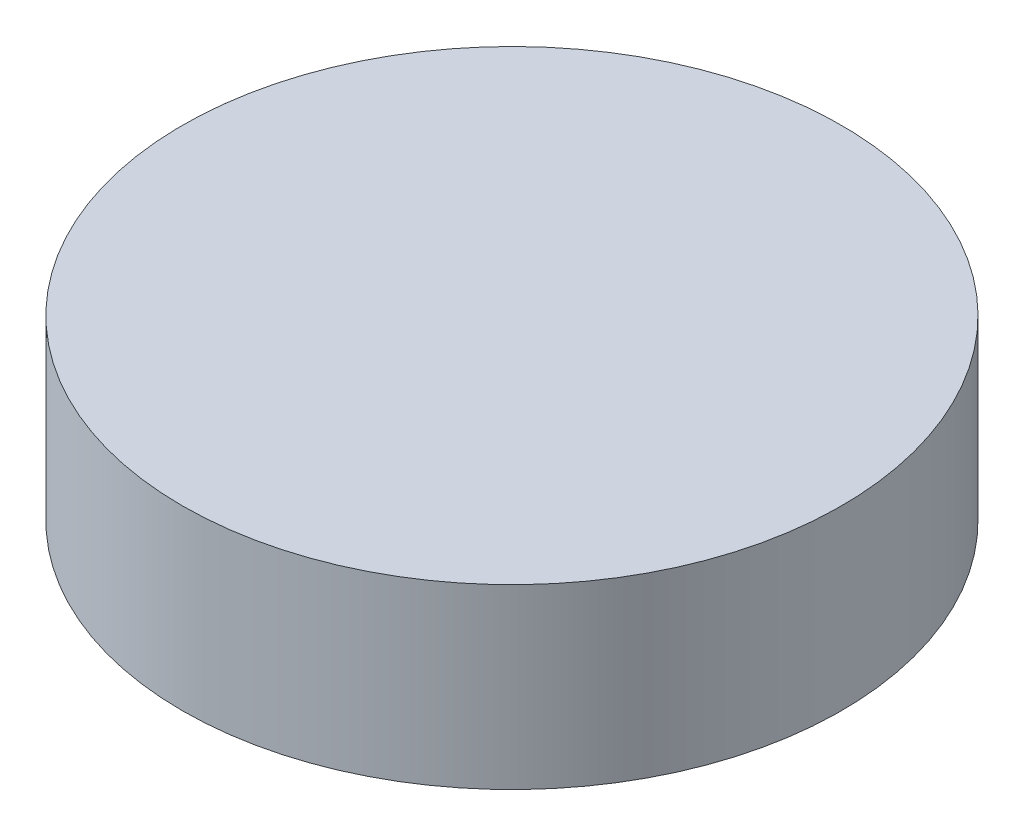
from build123d import *

# Parameters (mm, degrees)
CROQUIS1_R              = 65
SALIENTE_EXTRUIR1_DEPTH = 35


with BuildPart() as part:
    # Croquis1 → Saliente-Extruir1 (new body)
    with BuildSketch(Plane(origin=(0, 0, 0), x_dir=(1, 0, 0), z_dir=(0, 1, 0))):
        with Locations(Location((0, 0, 0), (0, 0, 270))):
            Circle(CROQUIS1_R)
    extrude(amount=SALIENTE_EXTRUIR1_DEPTH)


solid = part.part
